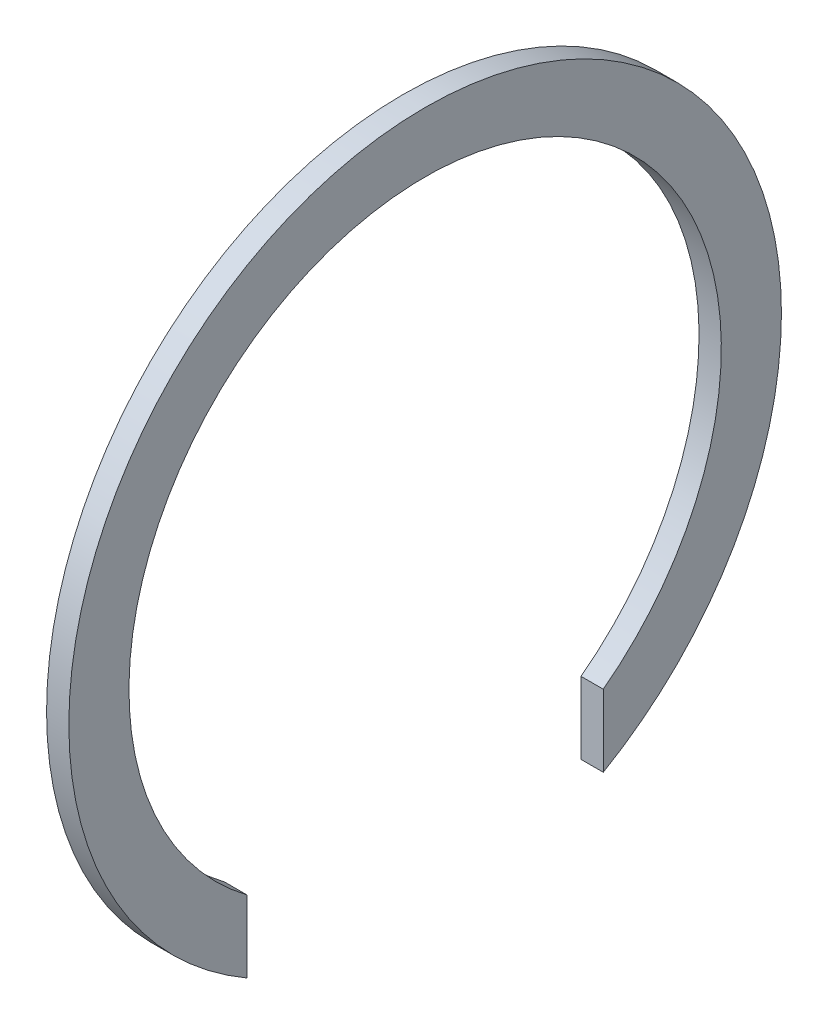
ISO-10303-21;
HEADER;
FILE_DESCRIPTION(('STEP AP214'),'2;1');
FILE_NAME('part.step','',(''),(''),'','','');
FILE_SCHEMA(('AUTOMOTIVE_DESIGN { 1 0 10303 214 1 1 1 1 }'));
ENDSEC;
DATA;
#1=APPLICATION_CONTEXT('core data for automotive mechanical design processes');
#2=APPLICATION_PROTOCOL_DEFINITION('international standard','automotive_design',2000,#1);
#3=PRODUCT_CONTEXT('',#1,'mechanical');
#4=PRODUCT('Part','Part','',(#3));
#5=PRODUCT_RELATED_PRODUCT_CATEGORY('part','',(#4));
#6=PRODUCT_DEFINITION_FORMATION('','',#4);
#7=PRODUCT_DEFINITION_CONTEXT('part definition',#1,'design');
#8=PRODUCT_DEFINITION('design','',#6,#7);
#9=PRODUCT_DEFINITION_SHAPE('','',#8);
#10=(LENGTH_UNIT() NAMED_UNIT(*) SI_UNIT(.MILLI.,.METRE.));
#11=(NAMED_UNIT(*) PLANE_ANGLE_UNIT() SI_UNIT($,.RADIAN.));
#12=(NAMED_UNIT(*) SI_UNIT($,.STERADIAN.) SOLID_ANGLE_UNIT());
#13=UNCERTAINTY_MEASURE_WITH_UNIT(LENGTH_MEASURE(1.E-05),#10,'distance_accuracy_value','');
#14=(GEOMETRIC_REPRESENTATION_CONTEXT(3) GLOBAL_UNCERTAINTY_ASSIGNED_CONTEXT((#13)) GLOBAL_UNIT_ASSIGNED_CONTEXT((#10,
#11,#12)) REPRESENTATION_CONTEXT('',''));
#15=CARTESIAN_POINT('',(0.,0.,0.));
#16=DIRECTION('',(0.,0.,1.));
#17=DIRECTION('',(1.,0.,0.));
#18=AXIS2_PLACEMENT_3D('',#15,#16,#17);
#19=CARTESIAN_POINT('',(0.5,0.,0.));
#20=DIRECTION('',(-1.,0.,0.));
#21=DIRECTION('',(0.,0.,1.));
#22=AXIS2_PLACEMENT_3D('',#19,#20,#21);
#23=CYLINDRICAL_SURFACE('',#22,8.);
#24=CARTESIAN_POINT('',(0.,0.,0.));
#25=DIRECTION('',(1.,0.,0.));
#26=DIRECTION('',(0.,0.,-1.));
#27=AXIS2_PLACEMENT_3D('',#24,#25,#26);
#28=CIRCLE('',#27,8.);
#29=CARTESIAN_POINT('',(0.,-6.92820323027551,-4.));
#30=VERTEX_POINT('',#29);
#31=CARTESIAN_POINT('',(0.,-6.92820323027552,4.00000000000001));
#32=VERTEX_POINT('',#31);
#33=EDGE_CURVE('E95',#30,#32,#28,.T.);
#34=ORIENTED_EDGE('',*,*,#33,.T.);
#35=DIRECTION('',(-1.,0.,0.));
#36=VECTOR('',#35,1.);
#37=CARTESIAN_POINT('',(0.5,-6.92820323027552,4.00000000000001));
#38=LINE('',#37,#36);
#39=CARTESIAN_POINT('',(0.5,-6.92820323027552,4.00000000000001));
#40=VERTEX_POINT('',#39);
#41=EDGE_CURVE('E11',#40,#32,#38,.T.);
#42=ORIENTED_EDGE('',*,*,#41,.F.);
#43=CARTESIAN_POINT('',(0.5,0.,0.));
#44=DIRECTION('',(1.,0.,0.));
#45=DIRECTION('',(0.,0.,-1.));
#46=AXIS2_PLACEMENT_3D('',#43,#44,#45);
#47=CIRCLE('',#46,8.);
#48=CARTESIAN_POINT('',(0.5,-6.92820323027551,-4.));
#49=VERTEX_POINT('',#48);
#50=EDGE_CURVE('E83',#49,#40,#47,.T.);
#51=ORIENTED_EDGE('',*,*,#50,.F.);
#52=DIRECTION('',(-1.,0.,0.));
#53=VECTOR('',#52,1.);
#54=CARTESIAN_POINT('',(0.5,-6.92820323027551,-4.));
#55=LINE('',#54,#53);
#56=EDGE_CURVE('E91',#49,#30,#55,.T.);
#57=ORIENTED_EDGE('',*,*,#56,.T.);
#58=EDGE_LOOP('',(#34,#42,#51,#57));
#59=FACE_BOUND('',#58,.T.);
#60=ADVANCED_FACE('F32',(#59),#23,.T.);
#61=CARTESIAN_POINT('',(0.5,-5.3124852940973,4.00000000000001));
#62=DIRECTION('',(0.,0.,1.));
#63=DIRECTION('',(0.,-1.,0.));
#64=AXIS2_PLACEMENT_3D('',#61,#62,#63);
#65=PLANE('',#64);
#66=DIRECTION('',(0.,1.,0.));
#67=VECTOR('',#66,1.);
#68=CARTESIAN_POINT('',(0.,-5.3124852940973,4.00000000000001));
#69=LINE('',#68,#67);
#70=CARTESIAN_POINT('',(0.,-5.3124852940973,4.00000000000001));
#71=VERTEX_POINT('',#70);
#72=EDGE_CURVE('E87',#32,#71,#69,.T.);
#73=ORIENTED_EDGE('',*,*,#72,.T.);
#74=DIRECTION('',(-1.,0.,0.));
#75=VECTOR('',#74,1.);
#76=CARTESIAN_POINT('',(0.5,-5.3124852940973,4.00000000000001));
#77=LINE('',#76,#75);
#78=CARTESIAN_POINT('',(0.5,-5.3124852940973,4.00000000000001));
#79=VERTEX_POINT('',#78);
#80=EDGE_CURVE('E40',#79,#71,#77,.T.);
#81=ORIENTED_EDGE('',*,*,#80,.F.);
#82=DIRECTION('',(0.,1.,0.));
#83=VECTOR('',#82,1.);
#84=CARTESIAN_POINT('',(0.5,-5.3124852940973,4.00000000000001));
#85=LINE('',#84,#83);
#86=EDGE_CURVE('E78',#40,#79,#85,.T.);
#87=ORIENTED_EDGE('',*,*,#86,.F.);
#88=ORIENTED_EDGE('',*,*,#41,.T.);
#89=EDGE_LOOP('',(#73,#81,#87,#88));
#90=FACE_BOUND('',#89,.T.);
#91=ADVANCED_FACE('F86',(#90),#65,.F.);
#92=CARTESIAN_POINT('',(0.5,0.,0.));
#93=DIRECTION('',(-1.,0.,0.));
#94=DIRECTION('',(0.,0.,1.));
#95=AXIS2_PLACEMENT_3D('',#92,#93,#94);
#96=CYLINDRICAL_SURFACE('',#95,6.65);
#97=CARTESIAN_POINT('',(0.,0.,0.));
#98=DIRECTION('',(-1.,0.,0.));
#99=DIRECTION('',(0.,0.,-1.));
#100=AXIS2_PLACEMENT_3D('',#97,#98,#99);
#101=CIRCLE('',#100,6.65);
#102=CARTESIAN_POINT('',(0.,-5.3124852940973,-4.));
#103=VERTEX_POINT('',#102);
#104=EDGE_CURVE('E65',#71,#103,#101,.T.);
#105=ORIENTED_EDGE('',*,*,#104,.T.);
#106=DIRECTION('',(-1.,0.,0.));
#107=VECTOR('',#106,1.);
#108=CARTESIAN_POINT('',(0.5,-5.3124852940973,-4.));
#109=LINE('',#108,#107);
#110=CARTESIAN_POINT('',(0.5,-5.3124852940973,-4.));
#111=VERTEX_POINT('',#110);
#112=EDGE_CURVE('E88',#111,#103,#109,.T.);
#113=ORIENTED_EDGE('',*,*,#112,.F.);
#114=CARTESIAN_POINT('',(0.5,0.,0.));
#115=DIRECTION('',(-1.,0.,0.));
#116=DIRECTION('',(0.,0.,-1.));
#117=AXIS2_PLACEMENT_3D('',#114,#115,#116);
#118=CIRCLE('',#117,6.65);
#119=EDGE_CURVE('E81',#79,#111,#118,.T.);
#120=ORIENTED_EDGE('',*,*,#119,.F.);
#121=ORIENTED_EDGE('',*,*,#80,.T.);
#122=EDGE_LOOP('',(#105,#113,#120,#121));
#123=FACE_BOUND('',#122,.T.);
#124=ADVANCED_FACE('F89',(#123),#96,.F.);
#125=CARTESIAN_POINT('',(0.5,-5.31248529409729,-4.));
#126=DIRECTION('',(0.,0.,-1.));
#127=DIRECTION('',(0.,1.,0.));
#128=AXIS2_PLACEMENT_3D('',#125,#126,#127);
#129=PLANE('',#128);
#130=DIRECTION('',(0.,-1.,0.));
#131=VECTOR('',#130,1.);
#132=CARTESIAN_POINT('',(0.,-5.31248529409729,-4.));
#133=LINE('',#132,#131);
#134=EDGE_CURVE('E71',#103,#30,#133,.T.);
#135=ORIENTED_EDGE('',*,*,#134,.T.);
#136=ORIENTED_EDGE('',*,*,#56,.F.);
#137=DIRECTION('',(0.,-1.,0.));
#138=VECTOR('',#137,1.);
#139=CARTESIAN_POINT('',(0.5,-5.31248529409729,-4.));
#140=LINE('',#139,#138);
#141=EDGE_CURVE('E48',#111,#49,#140,.T.);
#142=ORIENTED_EDGE('',*,*,#141,.F.);
#143=ORIENTED_EDGE('',*,*,#112,.T.);
#144=EDGE_LOOP('',(#135,#136,#142,#143));
#145=FACE_BOUND('',#144,.T.);
#146=ADVANCED_FACE('F102',(#145),#129,.F.);
#147=CARTESIAN_POINT('',(0.5,0.,0.));
#148=DIRECTION('',(1.,0.,0.));
#149=DIRECTION('',(0.,0.,-1.));
#150=AXIS2_PLACEMENT_3D('',#147,#148,#149);
#151=PLANE('',#150);
#152=ORIENTED_EDGE('',*,*,#50,.T.);
#153=ORIENTED_EDGE('',*,*,#86,.T.);
#154=ORIENTED_EDGE('',*,*,#119,.T.);
#155=ORIENTED_EDGE('',*,*,#141,.T.);
#156=EDGE_LOOP('',(#152,#153,#154,#155));
#157=FACE_BOUND('',#156,.T.);
#158=ADVANCED_FACE('F79',(#157),#151,.T.);
#159=CARTESIAN_POINT('',(0.,0.,0.));
#160=DIRECTION('',(1.,0.,0.));
#161=DIRECTION('',(0.,0.,-1.));
#162=AXIS2_PLACEMENT_3D('',#159,#160,#161);
#163=PLANE('',#162);
#164=ORIENTED_EDGE('',*,*,#33,.F.);
#165=ORIENTED_EDGE('',*,*,#134,.F.);
#166=ORIENTED_EDGE('',*,*,#104,.F.);
#167=ORIENTED_EDGE('',*,*,#72,.F.);
#168=EDGE_LOOP('',(#164,#165,#166,#167));
#169=FACE_BOUND('',#168,.T.);
#170=ADVANCED_FACE('F105',(#169),#163,.F.);
#171=CLOSED_SHELL('',(#60,#91,#124,#146,#158,#170));
#172=MANIFOLD_SOLID_BREP('B2',#171);
#173=ADVANCED_BREP_SHAPE_REPRESENTATION('',(#18,#172),#14);
#174=SHAPE_DEFINITION_REPRESENTATION(#9,#173);
ENDSEC;
END-ISO-10303-21;
